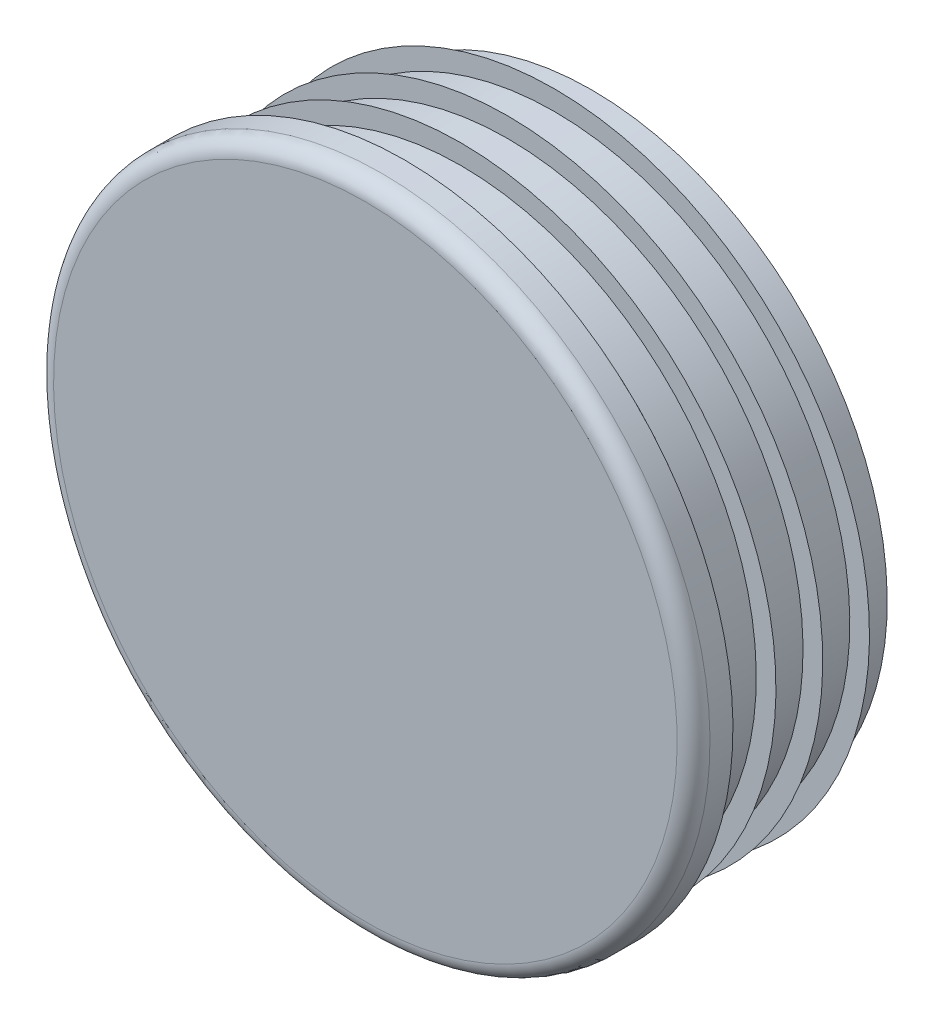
ISO-10303-21;
HEADER;
FILE_DESCRIPTION(('STEP AP214'),'2;1');
FILE_NAME('part.step','',(''),(''),'','','');
FILE_SCHEMA(('AUTOMOTIVE_DESIGN { 1 0 10303 214 1 1 1 1 }'));
ENDSEC;
DATA;
#1=APPLICATION_CONTEXT('core data for automotive mechanical design processes');
#2=APPLICATION_PROTOCOL_DEFINITION('international standard','automotive_design',2000,#1);
#3=PRODUCT_CONTEXT('',#1,'mechanical');
#4=PRODUCT('Part','Part','',(#3));
#5=PRODUCT_RELATED_PRODUCT_CATEGORY('part','',(#4));
#6=PRODUCT_DEFINITION_FORMATION('','',#4);
#7=PRODUCT_DEFINITION_CONTEXT('part definition',#1,'design');
#8=PRODUCT_DEFINITION('design','',#6,#7);
#9=PRODUCT_DEFINITION_SHAPE('','',#8);
#10=(LENGTH_UNIT() NAMED_UNIT(*) SI_UNIT(.MILLI.,.METRE.));
#11=(NAMED_UNIT(*) PLANE_ANGLE_UNIT() SI_UNIT($,.RADIAN.));
#12=(NAMED_UNIT(*) SI_UNIT($,.STERADIAN.) SOLID_ANGLE_UNIT());
#13=UNCERTAINTY_MEASURE_WITH_UNIT(LENGTH_MEASURE(1.E-05),#10,'distance_accuracy_value','');
#14=(GEOMETRIC_REPRESENTATION_CONTEXT(3) GLOBAL_UNCERTAINTY_ASSIGNED_CONTEXT((#13)) GLOBAL_UNIT_ASSIGNED_CONTEXT((#10,
#11,#12)) REPRESENTATION_CONTEXT('',''));
#15=CARTESIAN_POINT('',(0.,0.,0.));
#16=DIRECTION('',(0.,0.,1.));
#17=DIRECTION('',(1.,0.,0.));
#18=AXIS2_PLACEMENT_3D('',#15,#16,#17);
#19=CARTESIAN_POINT('',(0.,0.,6.));
#20=DIRECTION('',(0.,0.,-1.));
#21=DIRECTION('',(0.,1.,0.));
#22=AXIS2_PLACEMENT_3D('',#19,#20,#21);
#23=PLANE('',#22);
#24=CARTESIAN_POINT('',(0.,0.,6.));
#25=DIRECTION('',(0.,0.,-1.));
#26=DIRECTION('',(0.,1.,0.));
#27=AXIS2_PLACEMENT_3D('',#24,#25,#26);
#28=CIRCLE('',#27,47.5);
#29=CARTESIAN_POINT('',(0.,47.5,6.));
#30=VERTEX_POINT('',#29);
#31=EDGE_CURVE('E8',#30,#30,#28,.T.);
#32=ORIENTED_EDGE('',*,*,#31,.F.);
#33=EDGE_LOOP('',(#32));
#34=FACE_BOUND('',#33,.T.);
#35=ADVANCED_FACE('F12',(#34),#23,.F.);
#36=CARTESIAN_POINT('',(0.,0.,3.5));
#37=DIRECTION('',(0.,0.,-1.));
#38=DIRECTION('',(0.,1.,0.));
#39=AXIS2_PLACEMENT_3D('',#36,#37,#38);
#40=TOROIDAL_SURFACE('',#39,47.5,2.5);
#41=ORIENTED_EDGE('',*,*,#31,.T.);
#42=EDGE_LOOP('',(#41));
#43=FACE_BOUND('',#42,.T.);
#44=CARTESIAN_POINT('',(0.,0.,3.5));
#45=DIRECTION('',(0.,0.,-1.));
#46=DIRECTION('',(0.,1.,0.));
#47=AXIS2_PLACEMENT_3D('',#44,#45,#46);
#48=CIRCLE('',#47,50.);
#49=CARTESIAN_POINT('',(0.,50.,3.5));
#50=VERTEX_POINT('',#49);
#51=EDGE_CURVE('E18',#50,#50,#48,.T.);
#52=ORIENTED_EDGE('',*,*,#51,.F.);
#53=EDGE_LOOP('',(#52));
#54=FACE_BOUND('',#53,.T.);
#55=ADVANCED_FACE('F159',(#43,#54),#40,.T.);
#56=CARTESIAN_POINT('',(0.,0.,-28.5));
#57=DIRECTION('',(0.,0.,-1.));
#58=DIRECTION('',(0.,1.,0.));
#59=AXIS2_PLACEMENT_3D('',#56,#57,#58);
#60=CYLINDRICAL_SURFACE('',#59,50.);
#61=CARTESIAN_POINT('',(0.,0.,0.));
#62=DIRECTION('',(0.,0.,-1.));
#63=DIRECTION('',(0.,1.,0.));
#64=AXIS2_PLACEMENT_3D('',#61,#62,#63);
#65=CIRCLE('',#64,50.);
#66=CARTESIAN_POINT('',(0.,50.,0.));
#67=VERTEX_POINT('',#66);
#68=EDGE_CURVE('E22',#67,#67,#65,.T.);
#69=ORIENTED_EDGE('',*,*,#68,.F.);
#70=EDGE_LOOP('',(#69));
#71=FACE_BOUND('',#70,.T.);
#72=ORIENTED_EDGE('',*,*,#51,.T.);
#73=EDGE_LOOP('',(#72));
#74=FACE_BOUND('',#73,.T.);
#75=ADVANCED_FACE('F154',(#71,#74),#60,.T.);
#76=CARTESIAN_POINT('',(50.,0.,0.));
#77=DIRECTION('',(0.,0.,1.));
#78=DIRECTION('',(0.,-1.,0.));
#79=AXIS2_PLACEMENT_3D('',#76,#77,#78);
#80=PLANE('',#79);
#81=CARTESIAN_POINT('',(0.,0.,0.));
#82=DIRECTION('',(0.,0.,-1.));
#83=DIRECTION('',(0.,1.,0.));
#84=AXIS2_PLACEMENT_3D('',#81,#82,#83);
#85=CIRCLE('',#84,45.);
#86=CARTESIAN_POINT('',(0.,45.,0.));
#87=VERTEX_POINT('',#86);
#88=EDGE_CURVE('E26',#87,#87,#85,.T.);
#89=ORIENTED_EDGE('',*,*,#88,.F.);
#90=EDGE_LOOP('',(#89));
#91=FACE_BOUND('',#90,.T.);
#92=ORIENTED_EDGE('',*,*,#68,.T.);
#93=EDGE_LOOP('',(#92));
#94=FACE_BOUND('',#93,.T.);
#95=ADVANCED_FACE('F148',(#91,#94),#80,.F.);
#96=CARTESIAN_POINT('',(0.,0.,-28.5));
#97=DIRECTION('',(0.,0.,-1.));
#98=DIRECTION('',(0.,1.,0.));
#99=AXIS2_PLACEMENT_3D('',#96,#97,#98);
#100=CYLINDRICAL_SURFACE('',#99,45.);
#101=CARTESIAN_POINT('',(0.,0.,-1.425));
#102=DIRECTION('',(0.,0.,-1.));
#103=DIRECTION('',(0.,1.,0.));
#104=AXIS2_PLACEMENT_3D('',#101,#102,#103);
#105=CIRCLE('',#104,45.);
#106=CARTESIAN_POINT('',(0.,45.,-1.425));
#107=VERTEX_POINT('',#106);
#108=EDGE_CURVE('E31',#107,#107,#105,.T.);
#109=ORIENTED_EDGE('',*,*,#108,.F.);
#110=EDGE_LOOP('',(#109));
#111=FACE_BOUND('',#110,.T.);
#112=ORIENTED_EDGE('',*,*,#88,.T.);
#113=EDGE_LOOP('',(#112));
#114=FACE_BOUND('',#113,.T.);
#115=ADVANCED_FACE('F142',(#111,#114),#100,.T.);
#116=CARTESIAN_POINT('',(45.,0.,-1.425));
#117=DIRECTION('',(0.,0.,-1.));
#118=DIRECTION('',(0.,1.,0.));
#119=AXIS2_PLACEMENT_3D('',#116,#117,#118);
#120=PLANE('',#119);
#121=CARTESIAN_POINT('',(0.,0.,-1.425));
#122=DIRECTION('',(0.,0.,-1.));
#123=DIRECTION('',(0.,1.,0.));
#124=AXIS2_PLACEMENT_3D('',#121,#122,#123);
#125=CIRCLE('',#124,48.);
#126=CARTESIAN_POINT('',(0.,48.,-1.425));
#127=VERTEX_POINT('',#126);
#128=EDGE_CURVE('E34',#127,#127,#125,.T.);
#129=ORIENTED_EDGE('',*,*,#128,.F.);
#130=EDGE_LOOP('',(#129));
#131=FACE_BOUND('',#130,.T.);
#132=ORIENTED_EDGE('',*,*,#108,.T.);
#133=EDGE_LOOP('',(#132));
#134=FACE_BOUND('',#133,.T.);
#135=ADVANCED_FACE('F136',(#131,#134),#120,.F.);
#136=CARTESIAN_POINT('',(0.,0.,-1.425));
#137=DIRECTION('',(0.,0.,1.));
#138=DIRECTION('',(0.,-1.,0.));
#139=AXIS2_PLACEMENT_3D('',#136,#137,#138);
#140=CONICAL_SURFACE('',#139,48.,0.959931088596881);
#141=CARTESIAN_POINT('',(0.,0.,-3.52562261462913));
#142=DIRECTION('',(0.,0.,-1.));
#143=DIRECTION('',(0.,1.,0.));
#144=AXIS2_PLACEMENT_3D('',#141,#142,#143);
#145=CIRCLE('',#144,45.);
#146=CARTESIAN_POINT('',(0.,45.,-3.52562261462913));
#147=VERTEX_POINT('',#146);
#148=EDGE_CURVE('E37',#147,#147,#145,.T.);
#149=ORIENTED_EDGE('',*,*,#148,.F.);
#150=EDGE_LOOP('',(#149));
#151=FACE_BOUND('',#150,.T.);
#152=ORIENTED_EDGE('',*,*,#128,.T.);
#153=EDGE_LOOP('',(#152));
#154=FACE_BOUND('',#153,.T.);
#155=ADVANCED_FACE('F130',(#151,#154),#140,.T.);
#156=CARTESIAN_POINT('',(0.,0.,-28.5));
#157=DIRECTION('',(0.,0.,-1.));
#158=DIRECTION('',(0.,1.,0.));
#159=AXIS2_PLACEMENT_3D('',#156,#157,#158);
#160=CYLINDRICAL_SURFACE('',#159,45.);
#161=CARTESIAN_POINT('',(0.,0.,-8.55));
#162=DIRECTION('',(0.,0.,-1.));
#163=DIRECTION('',(0.,1.,0.));
#164=AXIS2_PLACEMENT_3D('',#161,#162,#163);
#165=CIRCLE('',#164,45.);
#166=CARTESIAN_POINT('',(0.,45.,-8.55));
#167=VERTEX_POINT('',#166);
#168=EDGE_CURVE('E40',#167,#167,#165,.T.);
#169=ORIENTED_EDGE('',*,*,#168,.F.);
#170=EDGE_LOOP('',(#169));
#171=FACE_BOUND('',#170,.T.);
#172=ORIENTED_EDGE('',*,*,#148,.T.);
#173=EDGE_LOOP('',(#172));
#174=FACE_BOUND('',#173,.T.);
#175=ADVANCED_FACE('F124',(#171,#174),#160,.T.);
#176=CARTESIAN_POINT('',(45.,0.,-8.55));
#177=DIRECTION('',(0.,0.,-1.));
#178=DIRECTION('',(0.,1.,0.));
#179=AXIS2_PLACEMENT_3D('',#176,#177,#178);
#180=PLANE('',#179);
#181=CARTESIAN_POINT('',(0.,0.,-8.55));
#182=DIRECTION('',(0.,0.,-1.));
#183=DIRECTION('',(0.,1.,0.));
#184=AXIS2_PLACEMENT_3D('',#181,#182,#183);
#185=CIRCLE('',#184,48.);
#186=CARTESIAN_POINT('',(0.,48.,-8.55));
#187=VERTEX_POINT('',#186);
#188=EDGE_CURVE('E43',#187,#187,#185,.T.);
#189=ORIENTED_EDGE('',*,*,#188,.F.);
#190=EDGE_LOOP('',(#189));
#191=FACE_BOUND('',#190,.T.);
#192=ORIENTED_EDGE('',*,*,#168,.T.);
#193=EDGE_LOOP('',(#192));
#194=FACE_BOUND('',#193,.T.);
#195=ADVANCED_FACE('F118',(#191,#194),#180,.F.);
#196=CARTESIAN_POINT('',(0.,0.,-8.55));
#197=DIRECTION('',(0.,0.,1.));
#198=DIRECTION('',(0.,-1.,0.));
#199=AXIS2_PLACEMENT_3D('',#196,#197,#198);
#200=CONICAL_SURFACE('',#199,48.,0.959931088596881);
#201=CARTESIAN_POINT('',(0.,0.,-10.6506226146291));
#202=DIRECTION('',(0.,0.,-1.));
#203=DIRECTION('',(0.,1.,0.));
#204=AXIS2_PLACEMENT_3D('',#201,#202,#203);
#205=CIRCLE('',#204,45.);
#206=CARTESIAN_POINT('',(0.,45.,-10.6506226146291));
#207=VERTEX_POINT('',#206);
#208=EDGE_CURVE('E46',#207,#207,#205,.T.);
#209=ORIENTED_EDGE('',*,*,#208,.F.);
#210=EDGE_LOOP('',(#209));
#211=FACE_BOUND('',#210,.T.);
#212=ORIENTED_EDGE('',*,*,#188,.T.);
#213=EDGE_LOOP('',(#212));
#214=FACE_BOUND('',#213,.T.);
#215=ADVANCED_FACE('F112',(#211,#214),#200,.T.);
#216=CARTESIAN_POINT('',(0.,0.,-28.5));
#217=DIRECTION('',(0.,0.,-1.));
#218=DIRECTION('',(0.,1.,0.));
#219=AXIS2_PLACEMENT_3D('',#216,#217,#218);
#220=CYLINDRICAL_SURFACE('',#219,45.);
#221=CARTESIAN_POINT('',(0.,0.,-15.675));
#222=DIRECTION('',(0.,0.,-1.));
#223=DIRECTION('',(0.,1.,0.));
#224=AXIS2_PLACEMENT_3D('',#221,#222,#223);
#225=CIRCLE('',#224,45.);
#226=CARTESIAN_POINT('',(0.,45.,-15.675));
#227=VERTEX_POINT('',#226);
#228=EDGE_CURVE('E49',#227,#227,#225,.T.);
#229=ORIENTED_EDGE('',*,*,#228,.F.);
#230=EDGE_LOOP('',(#229));
#231=FACE_BOUND('',#230,.T.);
#232=ORIENTED_EDGE('',*,*,#208,.T.);
#233=EDGE_LOOP('',(#232));
#234=FACE_BOUND('',#233,.T.);
#235=ADVANCED_FACE('F106',(#231,#234),#220,.T.);
#236=CARTESIAN_POINT('',(45.,0.,-15.675));
#237=DIRECTION('',(0.,0.,-1.));
#238=DIRECTION('',(0.,1.,0.));
#239=AXIS2_PLACEMENT_3D('',#236,#237,#238);
#240=PLANE('',#239);
#241=CARTESIAN_POINT('',(0.,0.,-15.675));
#242=DIRECTION('',(0.,0.,-1.));
#243=DIRECTION('',(0.,1.,0.));
#244=AXIS2_PLACEMENT_3D('',#241,#242,#243);
#245=CIRCLE('',#244,48.);
#246=CARTESIAN_POINT('',(0.,48.,-15.675));
#247=VERTEX_POINT('',#246);
#248=EDGE_CURVE('E52',#247,#247,#245,.T.);
#249=ORIENTED_EDGE('',*,*,#248,.F.);
#250=EDGE_LOOP('',(#249));
#251=FACE_BOUND('',#250,.T.);
#252=ORIENTED_EDGE('',*,*,#228,.T.);
#253=EDGE_LOOP('',(#252));
#254=FACE_BOUND('',#253,.T.);
#255=ADVANCED_FACE('F100',(#251,#254),#240,.F.);
#256=CARTESIAN_POINT('',(0.,0.,-15.675));
#257=DIRECTION('',(0.,0.,1.));
#258=DIRECTION('',(0.,-1.,0.));
#259=AXIS2_PLACEMENT_3D('',#256,#257,#258);
#260=CONICAL_SURFACE('',#259,48.,0.959931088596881);
#261=CARTESIAN_POINT('',(0.,0.,-17.7756226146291));
#262=DIRECTION('',(0.,0.,-1.));
#263=DIRECTION('',(0.,1.,0.));
#264=AXIS2_PLACEMENT_3D('',#261,#262,#263);
#265=CIRCLE('',#264,45.);
#266=CARTESIAN_POINT('',(0.,45.,-17.7756226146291));
#267=VERTEX_POINT('',#266);
#268=EDGE_CURVE('E55',#267,#267,#265,.T.);
#269=ORIENTED_EDGE('',*,*,#268,.F.);
#270=EDGE_LOOP('',(#269));
#271=FACE_BOUND('',#270,.T.);
#272=ORIENTED_EDGE('',*,*,#248,.T.);
#273=EDGE_LOOP('',(#272));
#274=FACE_BOUND('',#273,.T.);
#275=ADVANCED_FACE('F94',(#271,#274),#260,.T.);
#276=CARTESIAN_POINT('',(0.,0.,-28.5));
#277=DIRECTION('',(0.,0.,-1.));
#278=DIRECTION('',(0.,1.,0.));
#279=AXIS2_PLACEMENT_3D('',#276,#277,#278);
#280=CYLINDRICAL_SURFACE('',#279,45.);
#281=CARTESIAN_POINT('',(0.,0.,-22.8));
#282=DIRECTION('',(0.,0.,-1.));
#283=DIRECTION('',(0.,1.,0.));
#284=AXIS2_PLACEMENT_3D('',#281,#282,#283);
#285=CIRCLE('',#284,45.);
#286=CARTESIAN_POINT('',(0.,45.,-22.8));
#287=VERTEX_POINT('',#286);
#288=EDGE_CURVE('E58',#287,#287,#285,.T.);
#289=ORIENTED_EDGE('',*,*,#288,.F.);
#290=EDGE_LOOP('',(#289));
#291=FACE_BOUND('',#290,.T.);
#292=ORIENTED_EDGE('',*,*,#268,.T.);
#293=EDGE_LOOP('',(#292));
#294=FACE_BOUND('',#293,.T.);
#295=ADVANCED_FACE('F88',(#291,#294),#280,.T.);
#296=CARTESIAN_POINT('',(45.,0.,-22.8));
#297=DIRECTION('',(0.,0.,-1.));
#298=DIRECTION('',(0.,1.,0.));
#299=AXIS2_PLACEMENT_3D('',#296,#297,#298);
#300=PLANE('',#299);
#301=CARTESIAN_POINT('',(0.,0.,-22.8));
#302=DIRECTION('',(0.,0.,-1.));
#303=DIRECTION('',(0.,1.,0.));
#304=AXIS2_PLACEMENT_3D('',#301,#302,#303);
#305=CIRCLE('',#304,48.);
#306=CARTESIAN_POINT('',(0.,48.,-22.8));
#307=VERTEX_POINT('',#306);
#308=EDGE_CURVE('E61',#307,#307,#305,.T.);
#309=ORIENTED_EDGE('',*,*,#308,.F.);
#310=EDGE_LOOP('',(#309));
#311=FACE_BOUND('',#310,.T.);
#312=ORIENTED_EDGE('',*,*,#288,.T.);
#313=EDGE_LOOP('',(#312));
#314=FACE_BOUND('',#313,.T.);
#315=ADVANCED_FACE('F82',(#311,#314),#300,.F.);
#316=CARTESIAN_POINT('',(0.,0.,-22.8));
#317=DIRECTION('',(0.,0.,1.));
#318=DIRECTION('',(0.,-1.,0.));
#319=AXIS2_PLACEMENT_3D('',#316,#317,#318);
#320=CONICAL_SURFACE('',#319,48.,0.959931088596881);
#321=CARTESIAN_POINT('',(0.,0.,-24.9006226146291));
#322=DIRECTION('',(0.,0.,-1.));
#323=DIRECTION('',(0.,1.,0.));
#324=AXIS2_PLACEMENT_3D('',#321,#322,#323);
#325=CIRCLE('',#324,45.);
#326=CARTESIAN_POINT('',(0.,45.,-24.9006226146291));
#327=VERTEX_POINT('',#326);
#328=EDGE_CURVE('E64',#327,#327,#325,.T.);
#329=ORIENTED_EDGE('',*,*,#328,.F.);
#330=EDGE_LOOP('',(#329));
#331=FACE_BOUND('',#330,.T.);
#332=ORIENTED_EDGE('',*,*,#308,.T.);
#333=EDGE_LOOP('',(#332));
#334=FACE_BOUND('',#333,.T.);
#335=ADVANCED_FACE('F76',(#331,#334),#320,.T.);
#336=CARTESIAN_POINT('',(0.,0.,-28.5));
#337=DIRECTION('',(0.,0.,-1.));
#338=DIRECTION('',(0.,1.,0.));
#339=AXIS2_PLACEMENT_3D('',#336,#337,#338);
#340=CYLINDRICAL_SURFACE('',#339,45.);
#341=CARTESIAN_POINT('',(0.,0.,-28.5));
#342=DIRECTION('',(0.,0.,-1.));
#343=DIRECTION('',(0.,1.,0.));
#344=AXIS2_PLACEMENT_3D('',#341,#342,#343);
#345=CIRCLE('',#344,45.);
#346=CARTESIAN_POINT('',(0.,45.,-28.5));
#347=VERTEX_POINT('',#346);
#348=EDGE_CURVE('E67',#347,#347,#345,.T.);
#349=ORIENTED_EDGE('',*,*,#348,.F.);
#350=EDGE_LOOP('',(#349));
#351=FACE_BOUND('',#350,.T.);
#352=ORIENTED_EDGE('',*,*,#328,.T.);
#353=EDGE_LOOP('',(#352));
#354=FACE_BOUND('',#353,.T.);
#355=ADVANCED_FACE('F73',(#351,#354),#340,.T.);
#356=CARTESIAN_POINT('',(45.,0.,-28.5));
#357=DIRECTION('',(0.,0.,1.));
#358=DIRECTION('',(0.,-1.,0.));
#359=AXIS2_PLACEMENT_3D('',#356,#357,#358);
#360=PLANE('',#359);
#361=ORIENTED_EDGE('',*,*,#348,.T.);
#362=EDGE_LOOP('',(#361));
#363=FACE_BOUND('',#362,.T.);
#364=ADVANCED_FACE('F71',(#363),#360,.F.);
#365=CLOSED_SHELL('',(#35,#55,#75,#95,#115,#135,#155,#175,#195,#215,#235,#255,#275,#295,#315,
#335,#355,#364));
#366=MANIFOLD_SOLID_BREP('B1',#365);
#367=ADVANCED_BREP_SHAPE_REPRESENTATION('',(#18,#366),#14);
#368=SHAPE_DEFINITION_REPRESENTATION(#9,#367);
ENDSEC;
END-ISO-10303-21;
